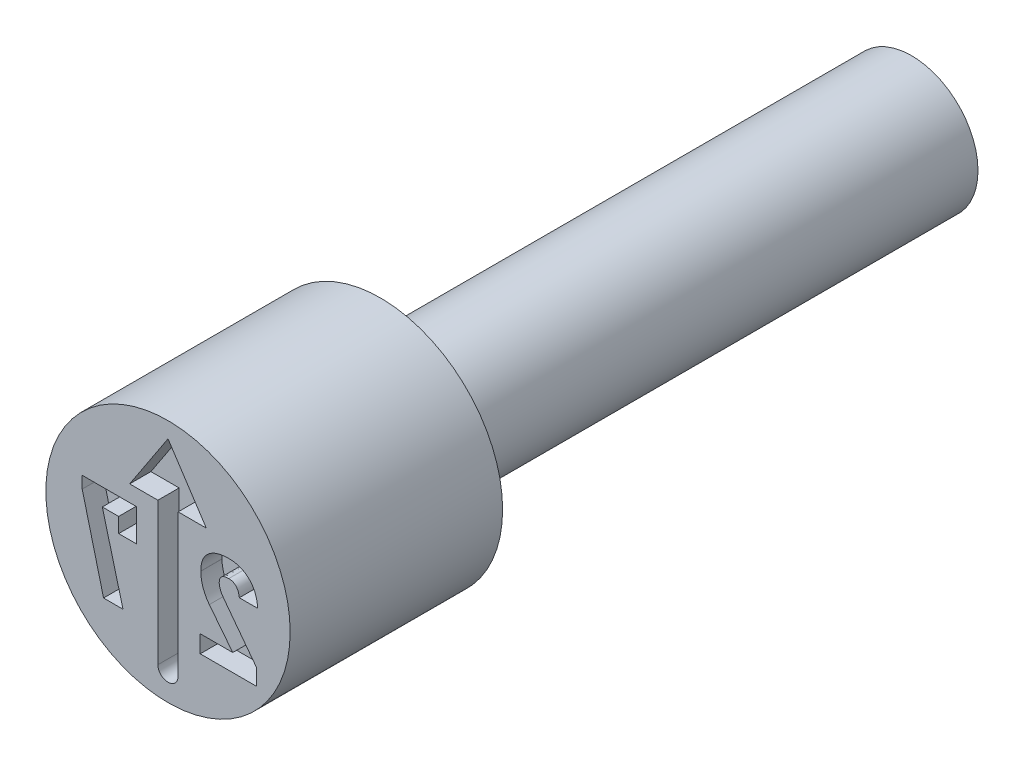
ISO-10303-21;
HEADER;
FILE_DESCRIPTION(('STEP AP214'),'2;1');
FILE_NAME('part.step','',(''),(''),'','','');
FILE_SCHEMA(('AUTOMOTIVE_DESIGN { 1 0 10303 214 1 1 1 1 }'));
ENDSEC;
DATA;
#1=APPLICATION_CONTEXT('core data for automotive mechanical design processes');
#2=APPLICATION_PROTOCOL_DEFINITION('international standard','automotive_design',2000,#1);
#3=PRODUCT_CONTEXT('',#1,'mechanical');
#4=PRODUCT('Part','Part','',(#3));
#5=PRODUCT_RELATED_PRODUCT_CATEGORY('part','',(#4));
#6=PRODUCT_DEFINITION_FORMATION('','',#4);
#7=PRODUCT_DEFINITION_CONTEXT('part definition',#1,'design');
#8=PRODUCT_DEFINITION('design','',#6,#7);
#9=PRODUCT_DEFINITION_SHAPE('','',#8);
#10=(LENGTH_UNIT() NAMED_UNIT(*) SI_UNIT(.MILLI.,.METRE.));
#11=(NAMED_UNIT(*) PLANE_ANGLE_UNIT() SI_UNIT($,.RADIAN.));
#12=(NAMED_UNIT(*) SI_UNIT($,.STERADIAN.) SOLID_ANGLE_UNIT());
#13=UNCERTAINTY_MEASURE_WITH_UNIT(LENGTH_MEASURE(1.E-05),#10,'distance_accuracy_value','');
#14=(GEOMETRIC_REPRESENTATION_CONTEXT(3) GLOBAL_UNCERTAINTY_ASSIGNED_CONTEXT((#13)) GLOBAL_UNIT_ASSIGNED_CONTEXT((#10,
#11,#12)) REPRESENTATION_CONTEXT('',''));
#15=CARTESIAN_POINT('',(0.,0.,0.));
#16=DIRECTION('',(0.,0.,1.));
#17=DIRECTION('',(1.,0.,0.));
#18=AXIS2_PLACEMENT_3D('',#15,#16,#17);
#19=CARTESIAN_POINT('',(0.,1.25,-4.));
#20=DIRECTION('',(0.,0.,1.));
#21=DIRECTION('',(1.,0.,0.));
#22=AXIS2_PLACEMENT_3D('',#19,#20,#21);
#23=PLANE('',#22);
#24=CARTESIAN_POINT('',(0.,0.,-4.));
#25=DIRECTION('',(0.,0.,1.));
#26=DIRECTION('',(1.,0.,0.));
#27=AXIS2_PLACEMENT_3D('',#24,#25,#26);
#28=CIRCLE('',#27,2.3);
#29=CARTESIAN_POINT('',(2.3,0.,-4.));
#30=VERTEX_POINT('',#29);
#31=EDGE_CURVE('E11',#30,#30,#28,.T.);
#32=ORIENTED_EDGE('',*,*,#31,.F.);
#33=EDGE_LOOP('',(#32));
#34=FACE_BOUND('',#33,.T.);
#35=CARTESIAN_POINT('',(0.,0.,-4.));
#36=DIRECTION('',(0.,0.,1.));
#37=DIRECTION('',(1.,0.,0.));
#38=AXIS2_PLACEMENT_3D('',#35,#36,#37);
#39=CIRCLE('',#38,1.25);
#40=CARTESIAN_POINT('',(1.25,0.,-4.));
#41=VERTEX_POINT('',#40);
#42=EDGE_CURVE('E405',#41,#41,#39,.T.);
#43=ORIENTED_EDGE('',*,*,#42,.T.);
#44=EDGE_LOOP('',(#43));
#45=FACE_BOUND('',#44,.T.);
#46=ADVANCED_FACE('F39',(#34,#45),#23,.F.);
#47=CARTESIAN_POINT('',(0.,0.,-0.403888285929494));
#48=DIRECTION('',(0.,0.,1.));
#49=DIRECTION('',(1.,0.,0.));
#50=AXIS2_PLACEMENT_3D('',#47,#48,#49);
#51=CYLINDRICAL_SURFACE('',#50,2.3);
#52=CARTESIAN_POINT('',(0.,0.,0.));
#53=DIRECTION('',(0.,0.,1.));
#54=DIRECTION('',(1.,0.,0.));
#55=AXIS2_PLACEMENT_3D('',#52,#53,#54);
#56=CIRCLE('',#55,2.3);
#57=CARTESIAN_POINT('',(2.3,0.,0.));
#58=VERTEX_POINT('',#57);
#59=EDGE_CURVE('E46',#58,#58,#56,.T.);
#60=ORIENTED_EDGE('',*,*,#59,.F.);
#61=EDGE_LOOP('',(#60));
#62=FACE_BOUND('',#61,.T.);
#63=ORIENTED_EDGE('',*,*,#31,.T.);
#64=EDGE_LOOP('',(#63));
#65=FACE_BOUND('',#64,.T.);
#66=ADVANCED_FACE('F390',(#62,#65),#51,.T.);
#67=CARTESIAN_POINT('',(0.,2.3,0.));
#68=DIRECTION('',(0.,0.,-1.));
#69=DIRECTION('',(-1.,0.,0.));
#70=AXIS2_PLACEMENT_3D('',#67,#68,#69);
#71=PLANE('',#70);
#72=DIRECTION('',(0.,1.,0.));
#73=VECTOR('',#72,1.);
#74=CARTESIAN_POINT('',(1.66668019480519,-1.2,0.));
#75=LINE('',#74,#73);
#76=CARTESIAN_POINT('',(1.66668019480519,-1.2,0.));
#77=VERTEX_POINT('',#76);
#78=CARTESIAN_POINT('',(1.66668019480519,-0.893912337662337,0.));
#79=VERTEX_POINT('',#78);
#80=EDGE_CURVE('E640',#77,#79,#75,.T.);
#81=ORIENTED_EDGE('',*,*,#80,.F.);
#82=DIRECTION('',(1.,0.,0.));
#83=VECTOR('',#82,1.);
#84=CARTESIAN_POINT('',(0.606696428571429,-1.2,0.));
#85=LINE('',#84,#83);
#86=CARTESIAN_POINT('',(0.606696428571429,-1.2,0.));
#87=VERTEX_POINT('',#86);
#88=EDGE_CURVE('E53',#87,#77,#85,.T.);
#89=ORIENTED_EDGE('',*,*,#88,.F.);
#90=DIRECTION('',(0.,-1.,0.));
#91=VECTOR('',#90,1.);
#92=CARTESIAN_POINT('',(0.606696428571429,-0.872727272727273,0.));
#93=LINE('',#92,#91);
#94=CARTESIAN_POINT('',(0.606696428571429,-0.872727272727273,0.));
#95=VERTEX_POINT('',#94);
#96=EDGE_CURVE('E274',#95,#87,#93,.T.);
#97=ORIENTED_EDGE('',*,*,#96,.F.);
#98=DIRECTION('',(-1.,0.,0.));
#99=VECTOR('',#98,1.);
#100=CARTESIAN_POINT('',(1.21923701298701,-0.872727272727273,0.));
#101=LINE('',#100,#99);
#102=CARTESIAN_POINT('',(1.21923701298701,-0.872727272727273,0.));
#103=VERTEX_POINT('',#102);
#104=EDGE_CURVE('E277',#103,#95,#101,.T.);
#105=ORIENTED_EDGE('',*,*,#104,.F.);
#106=DIRECTION('',(0.618183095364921,-0.78603413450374,0.));
#107=VECTOR('',#106,1.);
#108=CARTESIAN_POINT('',(0.778003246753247,-0.311688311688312,0.));
#109=LINE('',#108,#107);
#110=CARTESIAN_POINT('',(0.778003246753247,-0.311688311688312,0.));
#111=VERTEX_POINT('',#110);
#112=EDGE_CURVE('E571',#111,#103,#109,.T.);
#113=ORIENTED_EDGE('',*,*,#112,.F.);
#114=CARTESIAN_POINT('',(0.616558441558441,0.151461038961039,0.));
#115=CARTESIAN_POINT('',(0.617024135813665,0.130980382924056,0.));
#116=CARTESIAN_POINT('',(0.617956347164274,0.0899828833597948,0.));
#117=CARTESIAN_POINT('',(0.626371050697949,0.0286244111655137,0.));
#118=CARTESIAN_POINT('',(0.639931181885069,-0.0324207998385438,0.));
#119=CARTESIAN_POINT('',(0.658554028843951,-0.0928578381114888,0.));
#120=CARTESIAN_POINT('',(0.681688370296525,-0.151639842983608,0.));
#121=CARTESIAN_POINT('',(0.709454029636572,-0.207961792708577,0.));
#122=CARTESIAN_POINT('',(0.740791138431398,-0.261848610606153,0.));
#123=CARTESIAN_POINT('',(0.765622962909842,-0.29510689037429,0.));
#124=CARTESIAN_POINT('',(0.778003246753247,-0.311688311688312,0.));
#125=B_SPLINE_CURVE_WITH_KNOTS('',3,(#114,#115,#116,#117,#118,#119,#120,#121,#122,#123,#124),
.UNSPECIFIED.,.F.,.F.,(4,1,1,1,1,1,1,1,4),(0.,0.123046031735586,0.246309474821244,
0.371480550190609,0.498560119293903,0.626024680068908,0.750715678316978,0.875715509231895,1.),.UNSPECIFIED.);
#126=CARTESIAN_POINT('',(0.616558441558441,0.151461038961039,0.));
#127=VERTEX_POINT('',#126);
#128=EDGE_CURVE('E574',#127,#111,#125,.T.);
#129=ORIENTED_EDGE('',*,*,#128,.F.);
#130=DIRECTION('',(0.,-1.,0.));
#131=VECTOR('',#130,1.);
#132=CARTESIAN_POINT('',(0.616558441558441,0.152922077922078,0.));
#133=LINE('',#132,#131);
#134=CARTESIAN_POINT('',(0.616558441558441,0.152922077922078,0.));
#135=VERTEX_POINT('',#134);
#136=EDGE_CURVE('E579',#135,#127,#133,.T.);
#137=ORIENTED_EDGE('',*,*,#136,.F.);
#138=CARTESIAN_POINT('',(1.14655032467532,0.623376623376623,0.));
#139=CARTESIAN_POINT('',(1.12607927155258,0.623085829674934,0.));
#140=CARTESIAN_POINT('',(1.08626578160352,0.622520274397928,0.));
#141=CARTESIAN_POINT('',(1.02830422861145,0.61641528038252,0.));
#142=CARTESIAN_POINT('',(0.973768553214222,0.607201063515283,0.));
#143=CARTESIAN_POINT('',(0.922746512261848,0.593721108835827,0.));
#144=CARTESIAN_POINT('',(0.875442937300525,0.576137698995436,0.));
#145=CARTESIAN_POINT('',(0.831716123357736,0.554936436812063,0.));
#146=CARTESIAN_POINT('',(0.791474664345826,0.529936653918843,0.));
#147=CARTESIAN_POINT('',(0.755026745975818,0.501084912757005,0.));
#148=CARTESIAN_POINT('',(0.722232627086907,0.468905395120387,0.));
#149=CARTESIAN_POINT('',(0.694005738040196,0.433071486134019,0.));
#150=CARTESIAN_POINT('',(0.669570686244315,0.394307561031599,0.));
#151=CARTESIAN_POINT('',(0.650469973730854,0.3518617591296,0.));
#152=CARTESIAN_POINT('',(0.634744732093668,0.306732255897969,0.));
#153=CARTESIAN_POINT('',(0.624562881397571,0.25811011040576,0.));
#154=CARTESIAN_POINT('',(0.617701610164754,0.206567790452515,0.));
#155=CARTESIAN_POINT('',(0.616945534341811,0.171087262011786,0.));
#156=CARTESIAN_POINT('',(0.616558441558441,0.152922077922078,0.));
#157=B_SPLINE_CURVE_WITH_KNOTS('',3,(#138,#139,#140,#141,#142,#143,#144,#145,#146,#147,#148,
#149,#150,#151,#152,#153,#154,#155,#156),.UNSPECIFIED.,.F.,.F.,(4,1,1,1,1,1,1,1,1,1,1,1,1,1,1,1,
4),(0.,0.0762312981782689,0.148259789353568,0.216860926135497,0.28210063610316,
0.344528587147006,0.404571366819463,0.462840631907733,0.520642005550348,0.577409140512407,
0.633580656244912,0.690215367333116,0.747647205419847,0.806597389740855,0.867894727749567,
0.932365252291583,1.),.UNSPECIFIED.);
#158=CARTESIAN_POINT('',(1.14655032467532,0.623376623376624,0.));
#159=VERTEX_POINT('',#158);
#160=EDGE_CURVE('E585',#159,#135,#157,.T.);
#161=ORIENTED_EDGE('',*,*,#160,.F.);
#162=CARTESIAN_POINT('',(1.68896103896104,0.0831574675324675,0.));
#163=CARTESIAN_POINT('',(1.68725243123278,0.10402199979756,0.));
#164=CARTESIAN_POINT('',(1.68391726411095,0.144749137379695,0.));
#165=CARTESIAN_POINT('',(1.67298313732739,0.203662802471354,0.));
#166=CARTESIAN_POINT('',(1.658851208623,0.259155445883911,0.));
#167=CARTESIAN_POINT('',(1.64087349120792,0.311216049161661,0.));
#168=CARTESIAN_POINT('',(1.61777206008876,0.359241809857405,0.));
#169=CARTESIAN_POINT('',(1.59181690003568,0.404236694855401,0.));
#170=CARTESIAN_POINT('',(1.56059934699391,0.444809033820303,0.));
#171=CARTESIAN_POINT('',(1.52642736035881,0.482316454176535,0.));
#172=CARTESIAN_POINT('',(1.48836587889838,0.515352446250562,0.));
#173=CARTESIAN_POINT('',(1.44778188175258,0.544494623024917,0.));
#174=CARTESIAN_POINT('',(1.40406167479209,0.568745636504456,0.));
#175=CARTESIAN_POINT('',(1.35786992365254,0.588863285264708,0.));
#176=CARTESIAN_POINT('',(1.3086944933,0.604132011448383,0.));
#177=CARTESIAN_POINT('',(1.2571777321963,0.615569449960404,0.));
#178=CARTESIAN_POINT('',(1.20272832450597,0.622165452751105,0.));
#179=CARTESIAN_POINT('',(1.16556147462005,0.622966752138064,0.));
#180=CARTESIAN_POINT('',(1.14655032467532,0.623376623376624,0.));
#181=B_SPLINE_CURVE_WITH_KNOTS('',3,(#162,#163,#164,#165,#166,#167,#168,#169,#170,#171,#172,
#173,#174,#175,#176,#177,#178,#179,#180),.UNSPECIFIED.,.F.,.F.,(4,1,1,1,1,1,1,1,1,1,1,1,1,1,1,1,
4),(0.,0.0733268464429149,0.14313249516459,0.209679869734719,0.273918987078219,0.33576228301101,
0.396210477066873,0.45560885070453,0.514796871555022,0.573764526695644,0.631900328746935,
0.689592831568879,0.748648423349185,0.808163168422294,0.86976604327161,0.933384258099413,1.),.UNSPECIFIED.);
#182=CARTESIAN_POINT('',(1.68896103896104,0.0831574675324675,0.));
#183=VERTEX_POINT('',#182);
#184=EDGE_CURVE('E590',#183,#159,#181,.T.);
#185=ORIENTED_EDGE('',*,*,#184,.F.);
#186=DIRECTION('',(0.,1.,0.));
#187=VECTOR('',#186,1.);
#188=CARTESIAN_POINT('',(1.68896103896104,0.0820616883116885,0.));
#189=LINE('',#188,#187);
#190=CARTESIAN_POINT('',(1.68896103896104,0.0820616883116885,0.));
#191=VERTEX_POINT('',#190);
#192=EDGE_CURVE('E598',#191,#183,#189,.T.);
#193=ORIENTED_EDGE('',*,*,#192,.F.);
#194=DIRECTION('',(1.,0.,0.));
#195=VECTOR('',#194,1.);
#196=CARTESIAN_POINT('',(1.34269480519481,0.0820616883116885,0.));
#197=LINE('',#196,#195);
#198=CARTESIAN_POINT('',(1.34269480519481,0.0820616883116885,0.));
#199=VERTEX_POINT('',#198);
#200=EDGE_CURVE('E604',#199,#191,#197,.T.);
#201=ORIENTED_EDGE('',*,*,#200,.F.);
#202=DIRECTION('',(0.,-1.,0.));
#203=VECTOR('',#202,1.);
#204=CARTESIAN_POINT('',(1.34269480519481,0.0831574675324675,0.));
#205=LINE('',#204,#203);
#206=CARTESIAN_POINT('',(1.34269480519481,0.0831574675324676,0.));
#207=VERTEX_POINT('',#206);
#208=EDGE_CURVE('E607',#207,#199,#205,.T.);
#209=ORIENTED_EDGE('',*,*,#208,.F.);
#210=CARTESIAN_POINT('',(1.14399350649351,0.296103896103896,0.));
#211=CARTESIAN_POINT('',(1.15722614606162,0.295587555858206,0.));
#212=CARTESIAN_POINT('',(1.18293762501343,0.294584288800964,0.));
#213=CARTESIAN_POINT('',(1.21933660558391,0.283465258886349,0.));
#214=CARTESIAN_POINT('',(1.25213563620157,0.266024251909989,0.));
#215=CARTESIAN_POINT('',(1.28041100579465,0.241138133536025,0.));
#216=CARTESIAN_POINT('',(1.3038251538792,0.209892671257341,0.));
#217=CARTESIAN_POINT('',(1.32282800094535,0.173098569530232,0.));
#218=CARTESIAN_POINT('',(1.33573459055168,0.130091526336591,0.));
#219=CARTESIAN_POINT('',(1.34030007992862,0.0993055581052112,0.));
#220=CARTESIAN_POINT('',(1.34269480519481,0.0831574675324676,0.));
#221=B_SPLINE_CURVE_WITH_KNOTS('',3,(#210,#211,#212,#213,#214,#215,#216,#217,#218,#219,#220),
.UNSPECIFIED.,.F.,.F.,(4,1,1,1,1,1,1,1,4),(0.,0.122603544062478,0.238222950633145,
0.350089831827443,0.465559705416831,0.58502806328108,0.711014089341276,0.848418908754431,1.),.UNSPECIFIED.);
#222=CARTESIAN_POINT('',(1.14399350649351,0.296103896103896,0.));
#223=VERTEX_POINT('',#222);
#224=EDGE_CURVE('E610',#223,#207,#221,.T.);
#225=ORIENTED_EDGE('',*,*,#224,.F.);
#226=CARTESIAN_POINT('',(0.964285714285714,0.143425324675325,0.));
#227=CARTESIAN_POINT('',(0.964784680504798,0.154934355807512,0.));
#228=CARTESIAN_POINT('',(0.965740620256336,0.17698382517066,0.));
#229=CARTESIAN_POINT('',(0.97474707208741,0.208051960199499,0.));
#230=CARTESIAN_POINT('',(0.989508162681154,0.235107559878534,0.));
#231=CARTESIAN_POINT('',(1.0106496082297,0.257455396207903,0.));
#232=CARTESIAN_POINT('',(1.03696908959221,0.275131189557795,0.));
#233=CARTESIAN_POINT('',(1.06846107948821,0.287588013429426,0.));
#234=CARTESIAN_POINT('',(1.10471353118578,0.294731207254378,0.));
#235=CARTESIAN_POINT('',(1.13044539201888,0.295630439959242,0.));
#236=CARTESIAN_POINT('',(1.14399350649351,0.296103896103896,0.));
#237=B_SPLINE_CURVE_WITH_KNOTS('',3,(#226,#227,#228,#229,#230,#231,#232,#233,#234,#235,#236),
.UNSPECIFIED.,.F.,.F.,(4,1,1,1,1,1,1,1,4),(0.,0.128749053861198,0.246662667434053,
0.359069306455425,0.47107757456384,0.588039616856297,0.711712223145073,0.848213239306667,1.),.UNSPECIFIED.);
#238=CARTESIAN_POINT('',(0.964285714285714,0.143425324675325,0.));
#239=VERTEX_POINT('',#238);
#240=EDGE_CURVE('E615',#239,#223,#237,.T.);
#241=ORIENTED_EDGE('',*,*,#240,.F.);
#242=DIRECTION('',(0.,1.,0.));
#243=VECTOR('',#242,1.);
#244=CARTESIAN_POINT('',(0.964285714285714,0.140868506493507,0.));
#245=LINE('',#244,#243);
#246=CARTESIAN_POINT('',(0.964285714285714,0.140868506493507,0.));
#247=VERTEX_POINT('',#246);
#248=EDGE_CURVE('E623',#247,#239,#245,.T.);
#249=ORIENTED_EDGE('',*,*,#248,.F.);
#250=CARTESIAN_POINT('',(1.05158279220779,-0.0790178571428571,0.));
#251=CARTESIAN_POINT('',(1.03869946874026,-0.0608645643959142,0.));
#252=CARTESIAN_POINT('',(1.01359670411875,-0.0254934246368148,0.));
#253=CARTESIAN_POINT('',(0.990876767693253,0.0230816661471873,0.));
#254=CARTESIAN_POINT('',(0.976723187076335,0.0611651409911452,0.));
#255=CARTESIAN_POINT('',(0.969977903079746,0.0887831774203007,0.));
#256=CARTESIAN_POINT('',(0.965166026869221,0.115133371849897,0.));
#257=CARTESIAN_POINT('',(0.964573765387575,0.132447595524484,0.));
#258=CARTESIAN_POINT('',(0.964285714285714,0.140868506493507,0.));
#259=B_SPLINE_CURVE_WITH_KNOTS('',3,(#250,#251,#252,#253,#254,#255,#256,#257,#258),
.UNSPECIFIED.,.F.,.F.,(4,1,1,1,1,1,4),(0.,0.27737542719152,0.540457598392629,0.666416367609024,
0.784009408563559,0.894951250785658,1.),.UNSPECIFIED.);
#260=CARTESIAN_POINT('',(1.05158279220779,-0.0790178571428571,0.));
#261=VERTEX_POINT('',#260);
#262=EDGE_CURVE('E629',#261,#247,#259,.T.);
#263=ORIENTED_EDGE('',*,*,#262,.F.);
#264=DIRECTION('',(-0.602458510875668,0.798150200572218,0.));
#265=VECTOR('',#264,1.);
#266=CARTESIAN_POINT('',(1.66668019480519,-0.893912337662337,0.));
#267=LINE('',#266,#265);
#268=EDGE_CURVE('E634',#79,#261,#267,.T.);
#269=ORIENTED_EDGE('',*,*,#268,.F.);
#270=EDGE_LOOP('',(#81,#89,#97,#105,#113,#129,#137,#161,#185,#193,#201,#209,#225,#241,#249,#263,#269));
#271=FACE_BOUND('',#270,.T.);
#272=DIRECTION('',(0.,-1.,0.));
#273=VECTOR('',#272,1.);
#274=CARTESIAN_POINT('',(-1.61514935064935,0.6,0.));
#275=LINE('',#274,#273);
#276=CARTESIAN_POINT('',(-1.61514935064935,0.6,0.));
#277=VERTEX_POINT('',#276);
#278=CARTESIAN_POINT('',(-1.61514935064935,0.374269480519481,0.));
#279=VERTEX_POINT('',#278);
#280=EDGE_CURVE('E510',#277,#279,#275,.T.);
#281=ORIENTED_EDGE('',*,*,#280,.F.);
#282=DIRECTION('',(-1.,0.,0.));
#283=VECTOR('',#282,1.);
#284=CARTESIAN_POINT('',(-0.590961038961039,0.6,0.));
#285=LINE('',#284,#283);
#286=CARTESIAN_POINT('',(-0.590961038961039,0.6,0.));
#287=VERTEX_POINT('',#286);
#288=EDGE_CURVE('E61',#287,#277,#285,.T.);
#289=ORIENTED_EDGE('',*,*,#288,.F.);
#290=DIRECTION('',(0.,1.,0.));
#291=VECTOR('',#290,1.);
#292=CARTESIAN_POINT('',(-0.590961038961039,-0.00779220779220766,0.));
#293=LINE('',#292,#291);
#294=CARTESIAN_POINT('',(-0.590961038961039,-0.00779220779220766,0.));
#295=VERTEX_POINT('',#294);
#296=EDGE_CURVE('E488',#295,#287,#293,.T.);
#297=ORIENTED_EDGE('',*,*,#296,.F.);
#298=DIRECTION('',(1.,0.,0.));
#299=VECTOR('',#298,1.);
#300=CARTESIAN_POINT('',(-0.9288262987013,-0.00779220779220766,0.));
#301=LINE('',#300,#299);
#302=CARTESIAN_POINT('',(-0.9288262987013,-0.00779220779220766,0.));
#303=VERTEX_POINT('',#302);
#304=EDGE_CURVE('E492',#303,#295,#301,.T.);
#305=ORIENTED_EDGE('',*,*,#304,.F.);
#306=DIRECTION('',(0.,-1.,0.));
#307=VECTOR('',#306,1.);
#308=CARTESIAN_POINT('',(-0.9288262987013,0.272727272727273,0.));
#309=LINE('',#308,#307);
#310=CARTESIAN_POINT('',(-0.9288262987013,0.272727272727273,0.));
#311=VERTEX_POINT('',#310);
#312=EDGE_CURVE('E495',#311,#303,#309,.T.);
#313=ORIENTED_EDGE('',*,*,#312,.F.);
#314=DIRECTION('',(1.,0.,0.));
#315=VECTOR('',#314,1.);
#316=CARTESIAN_POINT('',(-1.23674025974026,0.272727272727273,0.));
#317=LINE('',#316,#315);
#318=CARTESIAN_POINT('',(-1.23674025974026,0.272727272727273,0.));
#319=VERTEX_POINT('',#318);
#320=EDGE_CURVE('E498',#319,#311,#317,.T.);
#321=ORIENTED_EDGE('',*,*,#320,.F.);
#322=DIRECTION('',(-0.255602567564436,0.966781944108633,0.));
#323=VECTOR('',#322,1.);
#324=CARTESIAN_POINT('',(-0.847373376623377,-1.2,0.));
#325=LINE('',#324,#323);
#326=CARTESIAN_POINT('',(-0.847373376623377,-1.2,0.));
#327=VERTEX_POINT('',#326);
#328=EDGE_CURVE('E501',#327,#319,#325,.T.);
#329=ORIENTED_EDGE('',*,*,#328,.F.);
#330=DIRECTION('',(1.,0.,0.));
#331=VECTOR('',#330,1.);
#332=CARTESIAN_POINT('',(-1.21336363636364,-1.2,0.));
#333=LINE('',#332,#331);
#334=CARTESIAN_POINT('',(-1.21336363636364,-1.2,0.));
#335=VERTEX_POINT('',#334);
#336=EDGE_CURVE('E504',#335,#327,#333,.T.);
#337=ORIENTED_EDGE('',*,*,#336,.F.);
#338=DIRECTION('',(0.247293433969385,-0.968940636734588,0.));
#339=VECTOR('',#338,1.);
#340=CARTESIAN_POINT('',(-1.61514935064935,0.374269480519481,0.));
#341=LINE('',#340,#339);
#342=EDGE_CURVE('E507',#279,#335,#341,.T.);
#343=ORIENTED_EDGE('',*,*,#342,.F.);
#344=EDGE_LOOP('',(#281,#289,#297,#305,#313,#321,#329,#337,#343));
#345=FACE_BOUND('',#344,.T.);
#346=DIRECTION('',(0.,1.,0.));
#347=VECTOR('',#346,1.);
#348=CARTESIAN_POINT('',(0.190473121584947,0.906351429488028,0.));
#349=LINE('',#348,#347);
#350=CARTESIAN_POINT('',(0.190473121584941,-1.77616183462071,0.));
#351=VERTEX_POINT('',#350);
#352=CARTESIAN_POINT('',(0.190473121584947,0.906351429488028,0.));
#353=VERTEX_POINT('',#352);
#354=EDGE_CURVE('E444',#351,#353,#349,.T.);
#355=ORIENTED_EDGE('',*,*,#354,.F.);
#356=CARTESIAN_POINT('',(1.6342449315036E-13,-1.77616183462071,0.));
#357=DIRECTION('',(0.,0.,1.));
#358=DIRECTION('',(1.,0.,0.));
#359=AXIS2_PLACEMENT_3D('',#356,#357,#358);
#360=CIRCLE('',#359,0.190473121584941);
#361=CARTESIAN_POINT('',(-0.190473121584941,-1.77616183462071,0.));
#362=VERTEX_POINT('',#361);
#363=EDGE_CURVE('E447',#362,#351,#360,.T.);
#364=ORIENTED_EDGE('',*,*,#363,.F.);
#365=DIRECTION('',(0.,-1.,0.));
#366=VECTOR('',#365,1.);
#367=CARTESIAN_POINT('',(-0.190473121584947,0.906351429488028,0.));
#368=LINE('',#367,#366);
#369=CARTESIAN_POINT('',(-0.190473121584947,0.906351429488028,0.));
#370=VERTEX_POINT('',#369);
#371=EDGE_CURVE('E428',#370,#362,#368,.T.);
#372=ORIENTED_EDGE('',*,*,#371,.F.);
#373=DIRECTION('',(1.,0.,0.));
#374=VECTOR('',#373,1.);
#375=CARTESIAN_POINT('',(-0.721917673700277,0.906351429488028,0.));
#376=LINE('',#375,#374);
#377=CARTESIAN_POINT('',(-0.721917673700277,0.906351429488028,0.));
#378=VERTEX_POINT('',#377);
#379=EDGE_CURVE('E432',#378,#370,#376,.T.);
#380=ORIENTED_EDGE('',*,*,#379,.F.);
#381=DIRECTION('',(-0.550159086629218,-0.835059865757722,0.));
#382=VECTOR('',#381,1.);
#383=CARTESIAN_POINT('',(0.,2.00211534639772,0.));
#384=LINE('',#383,#382);
#385=CARTESIAN_POINT('',(0.,2.00211534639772,0.));
#386=VERTEX_POINT('',#385);
#387=EDGE_CURVE('E435',#386,#378,#384,.T.);
#388=ORIENTED_EDGE('',*,*,#387,.F.);
#389=DIRECTION('',(-0.550159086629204,0.835059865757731,0.));
#390=VECTOR('',#389,1.);
#391=CARTESIAN_POINT('',(0.,2.00211534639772,0.));
#392=LINE('',#391,#390);
#393=CARTESIAN_POINT('',(0.721917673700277,0.906351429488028,0.));
#394=VERTEX_POINT('',#393);
#395=EDGE_CURVE('E438',#394,#386,#392,.T.);
#396=ORIENTED_EDGE('',*,*,#395,.F.);
#397=DIRECTION('',(1.,0.,0.));
#398=VECTOR('',#397,1.);
#399=CARTESIAN_POINT('',(0.721917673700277,0.906351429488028,0.));
#400=LINE('',#399,#398);
#401=EDGE_CURVE('E441',#353,#394,#400,.T.);
#402=ORIENTED_EDGE('',*,*,#401,.F.);
#403=EDGE_LOOP('',(#355,#364,#372,#380,#388,#396,#402));
#404=FACE_BOUND('',#403,.T.);
#405=ORIENTED_EDGE('',*,*,#59,.T.);
#406=EDGE_LOOP('',(#405));
#407=FACE_BOUND('',#406,.T.);
#408=ADVANCED_FACE('F387',(#271,#345,#404,#407),#71,.F.);
#409=CARTESIAN_POINT('',(0.,0.,-14.));
#410=DIRECTION('',(0.,0.,1.));
#411=DIRECTION('',(1.,0.,0.));
#412=AXIS2_PLACEMENT_3D('',#409,#410,#411);
#413=PLANE('',#412);
#414=CARTESIAN_POINT('',(0.,0.,-14.));
#415=DIRECTION('',(0.,0.,1.));
#416=DIRECTION('',(1.,0.,0.));
#417=AXIS2_PLACEMENT_3D('',#414,#415,#416);
#418=CIRCLE('',#417,1.25);
#419=CARTESIAN_POINT('',(1.25,0.,-14.));
#420=VERTEX_POINT('',#419);
#421=EDGE_CURVE('E406',#420,#420,#418,.T.);
#422=ORIENTED_EDGE('',*,*,#421,.F.);
#423=EDGE_LOOP('',(#422));
#424=FACE_BOUND('',#423,.T.);
#425=ADVANCED_FACE('F383',(#424),#413,.F.);
#426=CARTESIAN_POINT('',(0.,0.,-0.403888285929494));
#427=DIRECTION('',(0.,0.,1.));
#428=DIRECTION('',(1.,0.,0.));
#429=AXIS2_PLACEMENT_3D('',#426,#427,#428);
#430=CYLINDRICAL_SURFACE('',#429,1.25);
#431=ORIENTED_EDGE('',*,*,#42,.F.);
#432=EDGE_LOOP('',(#431));
#433=FACE_BOUND('',#432,.T.);
#434=ORIENTED_EDGE('',*,*,#421,.T.);
#435=EDGE_LOOP('',(#434));
#436=FACE_BOUND('',#435,.T.);
#437=ADVANCED_FACE('F379',(#433,#436),#430,.T.);
#438=CARTESIAN_POINT('',(1.6342449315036E-13,-1.77616183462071,-0.4));
#439=DIRECTION('',(0.,0.,1.));
#440=DIRECTION('',(1.,0.,0.));
#441=AXIS2_PLACEMENT_3D('',#438,#439,#440);
#442=CYLINDRICAL_SURFACE('',#441,0.190473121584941);
#443=ORIENTED_EDGE('',*,*,#363,.T.);
#444=DIRECTION('',(0.,0.,1.));
#445=VECTOR('',#444,1.);
#446=CARTESIAN_POINT('',(0.190473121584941,-1.77616183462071,-0.4));
#447=LINE('',#446,#445);
#448=CARTESIAN_POINT('',(0.190473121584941,-1.77616183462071,-0.4));
#449=VERTEX_POINT('',#448);
#450=EDGE_CURVE('E414',#449,#351,#447,.T.);
#451=ORIENTED_EDGE('',*,*,#450,.F.);
#452=CARTESIAN_POINT('',(1.6342449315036E-13,-1.77616183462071,-0.4));
#453=DIRECTION('',(0.,0.,1.));
#454=DIRECTION('',(1.,0.,0.));
#455=AXIS2_PLACEMENT_3D('',#452,#453,#454);
#456=CIRCLE('',#455,0.190473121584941);
#457=CARTESIAN_POINT('',(-0.190473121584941,-1.77616183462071,-0.4));
#458=VERTEX_POINT('',#457);
#459=EDGE_CURVE('E431',#458,#449,#456,.T.);
#460=ORIENTED_EDGE('',*,*,#459,.F.);
#461=DIRECTION('',(0.,0.,1.));
#462=VECTOR('',#461,1.);
#463=CARTESIAN_POINT('',(-0.190473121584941,-1.77616183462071,-0.4));
#464=LINE('',#463,#462);
#465=EDGE_CURVE('E407',#458,#362,#464,.T.);
#466=ORIENTED_EDGE('',*,*,#465,.T.);
#467=EDGE_LOOP('',(#443,#451,#460,#466));
#468=FACE_BOUND('',#467,.T.);
#469=ADVANCED_FACE('F357',(#468),#442,.F.);
#470=CARTESIAN_POINT('',(-0.190473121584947,0.906351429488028,-0.4));
#471=DIRECTION('',(-1.,0.,0.));
#472=DIRECTION('',(0.,-1.,0.));
#473=AXIS2_PLACEMENT_3D('',#470,#471,#472);
#474=PLANE('',#473);
#475=ORIENTED_EDGE('',*,*,#371,.T.);
#476=ORIENTED_EDGE('',*,*,#465,.F.);
#477=DIRECTION('',(0.,-1.,0.));
#478=VECTOR('',#477,1.);
#479=CARTESIAN_POINT('',(-0.190473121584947,0.906351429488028,-0.4));
#480=LINE('',#479,#478);
#481=CARTESIAN_POINT('',(-0.190473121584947,0.906351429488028,-0.4));
#482=VERTEX_POINT('',#481);
#483=EDGE_CURVE('E419',#482,#458,#480,.T.);
#484=ORIENTED_EDGE('',*,*,#483,.F.);
#485=DIRECTION('',(0.,0.,1.));
#486=VECTOR('',#485,1.);
#487=CARTESIAN_POINT('',(-0.190473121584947,0.906351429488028,-0.4));
#488=LINE('',#487,#486);
#489=EDGE_CURVE('E411',#482,#370,#488,.T.);
#490=ORIENTED_EDGE('',*,*,#489,.T.);
#491=EDGE_LOOP('',(#475,#476,#484,#490));
#492=FACE_BOUND('',#491,.T.);
#493=ADVANCED_FACE('F353',(#492),#474,.F.);
#494=CARTESIAN_POINT('',(-0.721917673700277,0.906351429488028,-0.4));
#495=DIRECTION('',(0.,-1.,0.));
#496=DIRECTION('',(0.,0.,-1.));
#497=AXIS2_PLACEMENT_3D('',#494,#495,#496);
#498=PLANE('',#497);
#499=ORIENTED_EDGE('',*,*,#379,.T.);
#500=ORIENTED_EDGE('',*,*,#489,.F.);
#501=DIRECTION('',(1.,0.,0.));
#502=VECTOR('',#501,1.);
#503=CARTESIAN_POINT('',(-0.721917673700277,0.906351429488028,-0.4));
#504=LINE('',#503,#502);
#505=CARTESIAN_POINT('',(-0.721917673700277,0.906351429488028,-0.4));
#506=VERTEX_POINT('',#505);
#507=EDGE_CURVE('E452',#506,#482,#504,.T.);
#508=ORIENTED_EDGE('',*,*,#507,.F.);
#509=DIRECTION('',(0.,0.,1.));
#510=VECTOR('',#509,1.);
#511=CARTESIAN_POINT('',(-0.721917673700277,0.906351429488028,-0.4));
#512=LINE('',#511,#510);
#513=EDGE_CURVE('E425',#506,#378,#512,.T.);
#514=ORIENTED_EDGE('',*,*,#513,.T.);
#515=EDGE_LOOP('',(#499,#500,#508,#514));
#516=FACE_BOUND('',#515,.T.);
#517=ADVANCED_FACE('F356',(#516),#498,.F.);
#518=CARTESIAN_POINT('',(0.,2.00211534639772,-0.4));
#519=DIRECTION('',(-0.835059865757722,0.550159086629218,0.));
#520=DIRECTION('',(-0.550159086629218,-0.835059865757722,0.));
#521=AXIS2_PLACEMENT_3D('',#518,#519,#520);
#522=PLANE('',#521);
#523=ORIENTED_EDGE('',*,*,#387,.T.);
#524=ORIENTED_EDGE('',*,*,#513,.F.);
#525=DIRECTION('',(-0.550159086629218,-0.835059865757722,0.));
#526=VECTOR('',#525,1.);
#527=CARTESIAN_POINT('',(0.,2.00211534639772,-0.4));
#528=LINE('',#527,#526);
#529=CARTESIAN_POINT('',(0.,2.00211534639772,-0.4));
#530=VERTEX_POINT('',#529);
#531=EDGE_CURVE('E455',#530,#506,#528,.T.);
#532=ORIENTED_EDGE('',*,*,#531,.F.);
#533=DIRECTION('',(0.,0.,1.));
#534=VECTOR('',#533,1.);
#535=CARTESIAN_POINT('',(0.,2.00211534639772,-0.4));
#536=LINE('',#535,#534);
#537=EDGE_CURVE('E423',#530,#386,#536,.T.);
#538=ORIENTED_EDGE('',*,*,#537,.T.);
#539=EDGE_LOOP('',(#523,#524,#532,#538));
#540=FACE_BOUND('',#539,.T.);
#541=ADVANCED_FACE('F361',(#540),#522,.F.);
#542=CARTESIAN_POINT('',(0.,2.00211534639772,-0.4));
#543=DIRECTION('',(0.835059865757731,0.550159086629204,0.));
#544=DIRECTION('',(-0.550159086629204,0.835059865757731,0.));
#545=AXIS2_PLACEMENT_3D('',#542,#543,#544);
#546=PLANE('',#545);
#547=ORIENTED_EDGE('',*,*,#395,.T.);
#548=ORIENTED_EDGE('',*,*,#537,.F.);
#549=DIRECTION('',(-0.550159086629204,0.835059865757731,0.));
#550=VECTOR('',#549,1.);
#551=CARTESIAN_POINT('',(0.,2.00211534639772,-0.4));
#552=LINE('',#551,#550);
#553=CARTESIAN_POINT('',(0.721917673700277,0.906351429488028,-0.4));
#554=VERTEX_POINT('',#553);
#555=EDGE_CURVE('E458',#554,#530,#552,.T.);
#556=ORIENTED_EDGE('',*,*,#555,.F.);
#557=DIRECTION('',(0.,0.,1.));
#558=VECTOR('',#557,1.);
#559=CARTESIAN_POINT('',(0.721917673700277,0.906351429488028,-0.4));
#560=LINE('',#559,#558);
#561=EDGE_CURVE('E421',#554,#394,#560,.T.);
#562=ORIENTED_EDGE('',*,*,#561,.T.);
#563=EDGE_LOOP('',(#547,#548,#556,#562));
#564=FACE_BOUND('',#563,.T.);
#565=ADVANCED_FACE('F365',(#564),#546,.F.);
#566=CARTESIAN_POINT('',(0.721917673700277,0.906351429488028,-0.4));
#567=DIRECTION('',(0.,-1.,0.));
#568=DIRECTION('',(0.,0.,-1.));
#569=AXIS2_PLACEMENT_3D('',#566,#567,#568);
#570=PLANE('',#569);
#571=ORIENTED_EDGE('',*,*,#401,.T.);
#572=ORIENTED_EDGE('',*,*,#561,.F.);
#573=DIRECTION('',(1.,0.,0.));
#574=VECTOR('',#573,1.);
#575=CARTESIAN_POINT('',(0.721917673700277,0.906351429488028,-0.4));
#576=LINE('',#575,#574);
#577=CARTESIAN_POINT('',(0.190473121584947,0.906351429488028,-0.4));
#578=VERTEX_POINT('',#577);
#579=EDGE_CURVE('E461',#578,#554,#576,.T.);
#580=ORIENTED_EDGE('',*,*,#579,.F.);
#581=DIRECTION('',(0.,0.,1.));
#582=VECTOR('',#581,1.);
#583=CARTESIAN_POINT('',(0.190473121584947,0.906351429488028,-0.4));
#584=LINE('',#583,#582);
#585=EDGE_CURVE('E418',#578,#353,#584,.T.);
#586=ORIENTED_EDGE('',*,*,#585,.T.);
#587=EDGE_LOOP('',(#571,#572,#580,#586));
#588=FACE_BOUND('',#587,.T.);
#589=ADVANCED_FACE('F369',(#588),#570,.F.);
#590=CARTESIAN_POINT('',(0.190473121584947,0.906351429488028,-0.4));
#591=DIRECTION('',(1.,0.,0.));
#592=DIRECTION('',(0.,1.,0.));
#593=AXIS2_PLACEMENT_3D('',#590,#591,#592);
#594=PLANE('',#593);
#595=ORIENTED_EDGE('',*,*,#354,.T.);
#596=ORIENTED_EDGE('',*,*,#585,.F.);
#597=DIRECTION('',(0.,1.,0.));
#598=VECTOR('',#597,1.);
#599=CARTESIAN_POINT('',(0.190473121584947,0.906351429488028,-0.4));
#600=LINE('',#599,#598);
#601=EDGE_CURVE('E464',#449,#578,#600,.T.);
#602=ORIENTED_EDGE('',*,*,#601,.F.);
#603=ORIENTED_EDGE('',*,*,#450,.T.);
#604=EDGE_LOOP('',(#595,#596,#602,#603));
#605=FACE_BOUND('',#604,.T.);
#606=ADVANCED_FACE('F351',(#605),#594,.F.);
#607=CARTESIAN_POINT('',(1.6342449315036E-13,-1.77616183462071,-0.4));
#608=DIRECTION('',(0.,0.,1.));
#609=DIRECTION('',(1.,0.,0.));
#610=AXIS2_PLACEMENT_3D('',#607,#608,#609);
#611=PLANE('',#610);
#612=ORIENTED_EDGE('',*,*,#459,.T.);
#613=ORIENTED_EDGE('',*,*,#601,.T.);
#614=ORIENTED_EDGE('',*,*,#579,.T.);
#615=ORIENTED_EDGE('',*,*,#555,.T.);
#616=ORIENTED_EDGE('',*,*,#531,.T.);
#617=ORIENTED_EDGE('',*,*,#507,.T.);
#618=ORIENTED_EDGE('',*,*,#483,.T.);
#619=EDGE_LOOP('',(#612,#613,#614,#615,#616,#617,#618));
#620=FACE_BOUND('',#619,.T.);
#621=ADVANCED_FACE('F348',(#620),#611,.T.);
#622=CARTESIAN_POINT('',(-0.590961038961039,0.6,-0.4));
#623=DIRECTION('',(0.,1.,0.));
#624=DIRECTION('',(0.,0.,1.));
#625=AXIS2_PLACEMENT_3D('',#622,#623,#624);
#626=PLANE('',#625);
#627=ORIENTED_EDGE('',*,*,#288,.T.);
#628=DIRECTION('',(0.,0.,1.));
#629=VECTOR('',#628,1.);
#630=CARTESIAN_POINT('',(-1.61514935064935,0.6,-0.4));
#631=LINE('',#630,#629);
#632=CARTESIAN_POINT('',(-1.61514935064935,0.6,-0.4));
#633=VERTEX_POINT('',#632);
#634=EDGE_CURVE('E469',#633,#277,#631,.T.);
#635=ORIENTED_EDGE('',*,*,#634,.F.);
#636=DIRECTION('',(-1.,0.,0.));
#637=VECTOR('',#636,1.);
#638=CARTESIAN_POINT('',(-0.590961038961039,0.6,-0.4));
#639=LINE('',#638,#637);
#640=CARTESIAN_POINT('',(-0.590961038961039,0.6,-0.4));
#641=VERTEX_POINT('',#640);
#642=EDGE_CURVE('E491',#641,#633,#639,.T.);
#643=ORIENTED_EDGE('',*,*,#642,.F.);
#644=DIRECTION('',(0.,0.,1.));
#645=VECTOR('',#644,1.);
#646=CARTESIAN_POINT('',(-0.590961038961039,0.6,-0.4));
#647=LINE('',#646,#645);
#648=EDGE_CURVE('E486',#641,#287,#647,.T.);
#649=ORIENTED_EDGE('',*,*,#648,.T.);
#650=EDGE_LOOP('',(#627,#635,#643,#649));
#651=FACE_BOUND('',#650,.T.);
#652=ADVANCED_FACE('F318',(#651),#626,.F.);
#653=CARTESIAN_POINT('',(-0.590961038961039,-0.00779220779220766,-0.4));
#654=DIRECTION('',(1.,0.,0.));
#655=DIRECTION('',(0.,0.,-1.));
#656=AXIS2_PLACEMENT_3D('',#653,#654,#655);
#657=PLANE('',#656);
#658=ORIENTED_EDGE('',*,*,#296,.T.);
#659=ORIENTED_EDGE('',*,*,#648,.F.);
#660=DIRECTION('',(0.,1.,0.));
#661=VECTOR('',#660,1.);
#662=CARTESIAN_POINT('',(-0.590961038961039,-0.00779220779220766,-0.4));
#663=LINE('',#662,#661);
#664=CARTESIAN_POINT('',(-0.590961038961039,-0.00779220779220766,-0.4));
#665=VERTEX_POINT('',#664);
#666=EDGE_CURVE('E472',#665,#641,#663,.T.);
#667=ORIENTED_EDGE('',*,*,#666,.F.);
#668=DIRECTION('',(0.,0.,1.));
#669=VECTOR('',#668,1.);
#670=CARTESIAN_POINT('',(-0.590961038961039,-0.00779220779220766,-0.4));
#671=LINE('',#670,#669);
#672=EDGE_CURVE('E484',#665,#295,#671,.T.);
#673=ORIENTED_EDGE('',*,*,#672,.T.);
#674=EDGE_LOOP('',(#658,#659,#667,#673));
#675=FACE_BOUND('',#674,.T.);
#676=ADVANCED_FACE('F314',(#675),#657,.F.);
#677=CARTESIAN_POINT('',(-0.9288262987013,-0.00779220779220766,-0.4));
#678=DIRECTION('',(0.,-1.,0.));
#679=DIRECTION('',(0.,0.,-1.));
#680=AXIS2_PLACEMENT_3D('',#677,#678,#679);
#681=PLANE('',#680);
#682=ORIENTED_EDGE('',*,*,#304,.T.);
#683=ORIENTED_EDGE('',*,*,#672,.F.);
#684=DIRECTION('',(1.,0.,0.));
#685=VECTOR('',#684,1.);
#686=CARTESIAN_POINT('',(-0.9288262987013,-0.00779220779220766,-0.4));
#687=LINE('',#686,#685);
#688=CARTESIAN_POINT('',(-0.9288262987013,-0.00779220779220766,-0.4));
#689=VERTEX_POINT('',#688);
#690=EDGE_CURVE('E516',#689,#665,#687,.T.);
#691=ORIENTED_EDGE('',*,*,#690,.F.);
#692=DIRECTION('',(0.,0.,1.));
#693=VECTOR('',#692,1.);
#694=CARTESIAN_POINT('',(-0.9288262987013,-0.00779220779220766,-0.4));
#695=LINE('',#694,#693);
#696=EDGE_CURVE('E482',#689,#303,#695,.T.);
#697=ORIENTED_EDGE('',*,*,#696,.T.);
#698=EDGE_LOOP('',(#682,#683,#691,#697));
#699=FACE_BOUND('',#698,.T.);
#700=ADVANCED_FACE('F317',(#699),#681,.F.);
#701=CARTESIAN_POINT('',(-0.9288262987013,0.272727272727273,-0.4));
#702=DIRECTION('',(-1.,0.,0.));
#703=DIRECTION('',(0.,0.,1.));
#704=AXIS2_PLACEMENT_3D('',#701,#702,#703);
#705=PLANE('',#704);
#706=ORIENTED_EDGE('',*,*,#312,.T.);
#707=ORIENTED_EDGE('',*,*,#696,.F.);
#708=DIRECTION('',(0.,-1.,0.));
#709=VECTOR('',#708,1.);
#710=CARTESIAN_POINT('',(-0.9288262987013,0.272727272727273,-0.4));
#711=LINE('',#710,#709);
#712=CARTESIAN_POINT('',(-0.9288262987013,0.272727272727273,-0.4));
#713=VERTEX_POINT('',#712);
#714=EDGE_CURVE('E519',#713,#689,#711,.T.);
#715=ORIENTED_EDGE('',*,*,#714,.F.);
#716=DIRECTION('',(0.,0.,1.));
#717=VECTOR('',#716,1.);
#718=CARTESIAN_POINT('',(-0.9288262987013,0.272727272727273,-0.4));
#719=LINE('',#718,#717);
#720=EDGE_CURVE('E480',#713,#311,#719,.T.);
#721=ORIENTED_EDGE('',*,*,#720,.T.);
#722=EDGE_LOOP('',(#706,#707,#715,#721));
#723=FACE_BOUND('',#722,.T.);
#724=ADVANCED_FACE('F322',(#723),#705,.F.);
#725=CARTESIAN_POINT('',(-1.23674025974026,0.272727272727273,-0.4));
#726=DIRECTION('',(0.,-1.,0.));
#727=DIRECTION('',(0.,0.,-1.));
#728=AXIS2_PLACEMENT_3D('',#725,#726,#727);
#729=PLANE('',#728);
#730=ORIENTED_EDGE('',*,*,#320,.T.);
#731=ORIENTED_EDGE('',*,*,#720,.F.);
#732=DIRECTION('',(1.,0.,0.));
#733=VECTOR('',#732,1.);
#734=CARTESIAN_POINT('',(-1.23674025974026,0.272727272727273,-0.4));
#735=LINE('',#734,#733);
#736=CARTESIAN_POINT('',(-1.23674025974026,0.272727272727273,-0.4));
#737=VERTEX_POINT('',#736);
#738=EDGE_CURVE('E522',#737,#713,#735,.T.);
#739=ORIENTED_EDGE('',*,*,#738,.F.);
#740=DIRECTION('',(0.,0.,1.));
#741=VECTOR('',#740,1.);
#742=CARTESIAN_POINT('',(-1.23674025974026,0.272727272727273,-0.4));
#743=LINE('',#742,#741);
#744=EDGE_CURVE('E478',#737,#319,#743,.T.);
#745=ORIENTED_EDGE('',*,*,#744,.T.);
#746=EDGE_LOOP('',(#730,#731,#739,#745));
#747=FACE_BOUND('',#746,.T.);
#748=ADVANCED_FACE('F326',(#747),#729,.F.);
#749=CARTESIAN_POINT('',(-0.847373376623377,-1.2,-0.4));
#750=DIRECTION('',(0.966781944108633,0.255602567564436,0.));
#751=DIRECTION('',(-0.255602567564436,0.966781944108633,0.));
#752=AXIS2_PLACEMENT_3D('',#749,#750,#751);
#753=PLANE('',#752);
#754=ORIENTED_EDGE('',*,*,#328,.T.);
#755=ORIENTED_EDGE('',*,*,#744,.F.);
#756=DIRECTION('',(-0.255602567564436,0.966781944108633,0.));
#757=VECTOR('',#756,1.);
#758=CARTESIAN_POINT('',(-0.847373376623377,-1.2,-0.4));
#759=LINE('',#758,#757);
#760=CARTESIAN_POINT('',(-0.847373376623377,-1.2,-0.4));
#761=VERTEX_POINT('',#760);
#762=EDGE_CURVE('E525',#761,#737,#759,.T.);
#763=ORIENTED_EDGE('',*,*,#762,.F.);
#764=DIRECTION('',(0.,0.,1.));
#765=VECTOR('',#764,1.);
#766=CARTESIAN_POINT('',(-0.847373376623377,-1.2,-0.4));
#767=LINE('',#766,#765);
#768=EDGE_CURVE('E476',#761,#327,#767,.T.);
#769=ORIENTED_EDGE('',*,*,#768,.T.);
#770=EDGE_LOOP('',(#754,#755,#763,#769));
#771=FACE_BOUND('',#770,.T.);
#772=ADVANCED_FACE('F330',(#771),#753,.F.);
#773=CARTESIAN_POINT('',(-1.21336363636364,-1.2,-0.4));
#774=DIRECTION('',(0.,-1.,0.));
#775=DIRECTION('',(0.,0.,-1.));
#776=AXIS2_PLACEMENT_3D('',#773,#774,#775);
#777=PLANE('',#776);
#778=ORIENTED_EDGE('',*,*,#336,.T.);
#779=ORIENTED_EDGE('',*,*,#768,.F.);
#780=DIRECTION('',(1.,0.,0.));
#781=VECTOR('',#780,1.);
#782=CARTESIAN_POINT('',(-1.21336363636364,-1.2,-0.4));
#783=LINE('',#782,#781);
#784=CARTESIAN_POINT('',(-1.21336363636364,-1.2,-0.4));
#785=VERTEX_POINT('',#784);
#786=EDGE_CURVE('E528',#785,#761,#783,.T.);
#787=ORIENTED_EDGE('',*,*,#786,.F.);
#788=DIRECTION('',(0.,0.,1.));
#789=VECTOR('',#788,1.);
#790=CARTESIAN_POINT('',(-1.21336363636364,-1.2,-0.4));
#791=LINE('',#790,#789);
#792=EDGE_CURVE('E474',#785,#335,#791,.T.);
#793=ORIENTED_EDGE('',*,*,#792,.T.);
#794=EDGE_LOOP('',(#778,#779,#787,#793));
#795=FACE_BOUND('',#794,.T.);
#796=ADVANCED_FACE('F334',(#795),#777,.F.);
#797=CARTESIAN_POINT('',(-1.61514935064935,0.374269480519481,-0.4));
#798=DIRECTION('',(-0.968940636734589,-0.247293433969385,0.));
#799=DIRECTION('',(0.247293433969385,-0.968940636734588,0.));
#800=AXIS2_PLACEMENT_3D('',#797,#798,#799);
#801=PLANE('',#800);
#802=ORIENTED_EDGE('',*,*,#342,.T.);
#803=ORIENTED_EDGE('',*,*,#792,.F.);
#804=DIRECTION('',(0.247293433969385,-0.968940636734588,0.));
#805=VECTOR('',#804,1.);
#806=CARTESIAN_POINT('',(-1.61514935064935,0.374269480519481,-0.4));
#807=LINE('',#806,#805);
#808=CARTESIAN_POINT('',(-1.61514935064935,0.374269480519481,-0.4));
#809=VERTEX_POINT('',#808);
#810=EDGE_CURVE('E531',#809,#785,#807,.T.);
#811=ORIENTED_EDGE('',*,*,#810,.F.);
#812=DIRECTION('',(0.,0.,1.));
#813=VECTOR('',#812,1.);
#814=CARTESIAN_POINT('',(-1.61514935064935,0.374269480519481,-0.4));
#815=LINE('',#814,#813);
#816=EDGE_CURVE('E471',#809,#279,#815,.T.);
#817=ORIENTED_EDGE('',*,*,#816,.T.);
#818=EDGE_LOOP('',(#802,#803,#811,#817));
#819=FACE_BOUND('',#818,.T.);
#820=ADVANCED_FACE('F338',(#819),#801,.F.);
#821=CARTESIAN_POINT('',(-1.61514935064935,0.6,-0.4));
#822=DIRECTION('',(-1.,0.,0.));
#823=DIRECTION('',(0.,0.,1.));
#824=AXIS2_PLACEMENT_3D('',#821,#822,#823);
#825=PLANE('',#824);
#826=ORIENTED_EDGE('',*,*,#280,.T.);
#827=ORIENTED_EDGE('',*,*,#816,.F.);
#828=DIRECTION('',(0.,-1.,0.));
#829=VECTOR('',#828,1.);
#830=CARTESIAN_POINT('',(-1.61514935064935,0.6,-0.4));
#831=LINE('',#830,#829);
#832=EDGE_CURVE('E534',#633,#809,#831,.T.);
#833=ORIENTED_EDGE('',*,*,#832,.F.);
#834=ORIENTED_EDGE('',*,*,#634,.T.);
#835=EDGE_LOOP('',(#826,#827,#833,#834));
#836=FACE_BOUND('',#835,.T.);
#837=ADVANCED_FACE('F312',(#836),#825,.F.);
#838=CARTESIAN_POINT('',(0.,0.,-0.4));
#839=DIRECTION('',(0.,0.,1.));
#840=DIRECTION('',(1.,0.,0.));
#841=AXIS2_PLACEMENT_3D('',#838,#839,#840);
#842=PLANE('',#841);
#843=ORIENTED_EDGE('',*,*,#642,.T.);
#844=ORIENTED_EDGE('',*,*,#832,.T.);
#845=ORIENTED_EDGE('',*,*,#810,.T.);
#846=ORIENTED_EDGE('',*,*,#786,.T.);
#847=ORIENTED_EDGE('',*,*,#762,.T.);
#848=ORIENTED_EDGE('',*,*,#738,.T.);
#849=ORIENTED_EDGE('',*,*,#714,.T.);
#850=ORIENTED_EDGE('',*,*,#690,.T.);
#851=ORIENTED_EDGE('',*,*,#666,.T.);
#852=EDGE_LOOP('',(#843,#844,#845,#846,#847,#848,#849,#850,#851));
#853=FACE_BOUND('',#852,.T.);
#854=ADVANCED_FACE('F309',(#853),#842,.T.);
#855=CARTESIAN_POINT('',(0.606696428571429,-1.2,-0.4));
#856=DIRECTION('',(0.,-1.,0.));
#857=DIRECTION('',(0.,0.,-1.));
#858=AXIS2_PLACEMENT_3D('',#855,#856,#857);
#859=PLANE('',#858);
#860=ORIENTED_EDGE('',*,*,#88,.T.);
#861=DIRECTION('',(0.,0.,1.));
#862=VECTOR('',#861,1.);
#863=CARTESIAN_POINT('',(1.66668019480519,-1.2,-0.4));
#864=LINE('',#863,#862);
#865=CARTESIAN_POINT('',(1.66668019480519,-1.2,-0.4));
#866=VERTEX_POINT('',#865);
#867=EDGE_CURVE('E251',#866,#77,#864,.T.);
#868=ORIENTED_EDGE('',*,*,#867,.F.);
#869=DIRECTION('',(1.,0.,0.));
#870=VECTOR('',#869,1.);
#871=CARTESIAN_POINT('',(0.606696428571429,-1.2,-0.4));
#872=LINE('',#871,#870);
#873=CARTESIAN_POINT('',(0.606696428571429,-1.2,-0.4));
#874=VERTEX_POINT('',#873);
#875=EDGE_CURVE('E255',#874,#866,#872,.T.);
#876=ORIENTED_EDGE('',*,*,#875,.F.);
#877=DIRECTION('',(0.,0.,1.));
#878=VECTOR('',#877,1.);
#879=CARTESIAN_POINT('',(0.606696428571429,-1.2,-0.4));
#880=LINE('',#879,#878);
#881=EDGE_CURVE('E449',#874,#87,#880,.T.);
#882=ORIENTED_EDGE('',*,*,#881,.T.);
#883=EDGE_LOOP('',(#860,#868,#876,#882));
#884=FACE_BOUND('',#883,.T.);
#885=ADVANCED_FACE('F253',(#884),#859,.F.);
#886=CARTESIAN_POINT('',(0.606696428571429,-0.872727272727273,-0.4));
#887=DIRECTION('',(-1.,0.,0.));
#888=DIRECTION('',(0.,0.,1.));
#889=AXIS2_PLACEMENT_3D('',#886,#887,#888);
#890=PLANE('',#889);
#891=ORIENTED_EDGE('',*,*,#96,.T.);
#892=ORIENTED_EDGE('',*,*,#881,.F.);
#893=DIRECTION('',(0.,-1.,0.));
#894=VECTOR('',#893,1.);
#895=CARTESIAN_POINT('',(0.606696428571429,-0.872727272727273,-0.4));
#896=LINE('',#895,#894);
#897=CARTESIAN_POINT('',(0.606696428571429,-0.872727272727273,-0.4));
#898=VERTEX_POINT('',#897);
#899=EDGE_CURVE('E261',#898,#874,#896,.T.);
#900=ORIENTED_EDGE('',*,*,#899,.F.);
#901=DIRECTION('',(0.,0.,1.));
#902=VECTOR('',#901,1.);
#903=CARTESIAN_POINT('',(0.606696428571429,-0.872727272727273,-0.4));
#904=LINE('',#903,#902);
#905=EDGE_CURVE('E566',#898,#95,#904,.T.);
#906=ORIENTED_EDGE('',*,*,#905,.T.);
#907=EDGE_LOOP('',(#891,#892,#900,#906));
#908=FACE_BOUND('',#907,.T.);
#909=ADVANCED_FACE('F308',(#908),#890,.F.);
#910=CARTESIAN_POINT('',(1.21923701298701,-0.872727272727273,-0.4));
#911=DIRECTION('',(0.,1.,0.));
#912=DIRECTION('',(0.,0.,1.));
#913=AXIS2_PLACEMENT_3D('',#910,#911,#912);
#914=PLANE('',#913);
#915=ORIENTED_EDGE('',*,*,#104,.T.);
#916=ORIENTED_EDGE('',*,*,#905,.F.);
#917=DIRECTION('',(-1.,0.,0.));
#918=VECTOR('',#917,1.);
#919=CARTESIAN_POINT('',(1.21923701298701,-0.872727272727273,-0.4));
#920=LINE('',#919,#918);
#921=CARTESIAN_POINT('',(1.21923701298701,-0.872727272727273,-0.4));
#922=VERTEX_POINT('',#921);
#923=EDGE_CURVE('E644',#922,#898,#920,.T.);
#924=ORIENTED_EDGE('',*,*,#923,.F.);
#925=DIRECTION('',(0.,0.,1.));
#926=VECTOR('',#925,1.);
#927=CARTESIAN_POINT('',(1.21923701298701,-0.872727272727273,-0.4));
#928=LINE('',#927,#926);
#929=EDGE_CURVE('E564',#922,#103,#928,.T.);
#930=ORIENTED_EDGE('',*,*,#929,.T.);
#931=EDGE_LOOP('',(#915,#916,#924,#930));
#932=FACE_BOUND('',#931,.T.);
#933=ADVANCED_FACE('F752',(#932),#914,.F.);
#934=CARTESIAN_POINT('',(0.778003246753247,-0.311688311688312,-0.4));
#935=DIRECTION('',(-0.78603413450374,-0.618183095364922,0.));
#936=DIRECTION('',(0.618183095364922,-0.786034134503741,0.));
#937=AXIS2_PLACEMENT_3D('',#934,#935,#936);
#938=PLANE('',#937);
#939=ORIENTED_EDGE('',*,*,#112,.T.);
#940=ORIENTED_EDGE('',*,*,#929,.F.);
#941=DIRECTION('',(0.618183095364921,-0.78603413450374,0.));
#942=VECTOR('',#941,1.);
#943=CARTESIAN_POINT('',(0.778003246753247,-0.311688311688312,-0.4));
#944=LINE('',#943,#942);
#945=CARTESIAN_POINT('',(0.778003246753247,-0.311688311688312,-0.4));
#946=VERTEX_POINT('',#945);
#947=EDGE_CURVE('E646',#946,#922,#944,.T.);
#948=ORIENTED_EDGE('',*,*,#947,.F.);
#949=DIRECTION('',(0.,0.,1.));
#950=VECTOR('',#949,1.);
#951=CARTESIAN_POINT('',(0.778003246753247,-0.311688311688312,-0.4));
#952=LINE('',#951,#950);
#953=EDGE_CURVE('E562',#946,#111,#952,.T.);
#954=ORIENTED_EDGE('',*,*,#953,.T.);
#955=EDGE_LOOP('',(#939,#940,#948,#954));
#956=FACE_BOUND('',#955,.T.);
#957=ADVANCED_FACE('F666',(#956),#938,.F.);
#958=CARTESIAN_POINT('',(0.616558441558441,0.151461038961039,-0.4));
#959=CARTESIAN_POINT('',(0.617024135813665,0.130980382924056,-0.4));
#960=CARTESIAN_POINT('',(0.617956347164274,0.0899828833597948,-0.4));
#961=CARTESIAN_POINT('',(0.626371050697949,0.0286244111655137,-0.4));
#962=CARTESIAN_POINT('',(0.639931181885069,-0.0324207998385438,-0.4));
#963=CARTESIAN_POINT('',(0.658554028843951,-0.0928578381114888,-0.4));
#964=CARTESIAN_POINT('',(0.681688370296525,-0.151639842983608,-0.4));
#965=CARTESIAN_POINT('',(0.709454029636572,-0.207961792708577,-0.4));
#966=CARTESIAN_POINT('',(0.740791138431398,-0.261848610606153,-0.4));
#967=CARTESIAN_POINT('',(0.765622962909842,-0.29510689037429,-0.4));
#968=CARTESIAN_POINT('',(0.778003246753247,-0.311688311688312,-0.4));
#969=B_SPLINE_CURVE_WITH_KNOTS('',3,(#958,#959,#960,#961,#962,#963,#964,#965,#966,#967,#968),
.UNSPECIFIED.,.F.,.F.,(4,1,1,1,1,1,1,1,4),(0.,0.123046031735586,0.246309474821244,
0.371480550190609,0.498560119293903,0.626024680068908,0.750715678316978,0.875715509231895,1.),.UNSPECIFIED.);
#970=DIRECTION('',(0.,0.,1.));
#971=VECTOR('',#970,1.);
#972=SURFACE_OF_LINEAR_EXTRUSION('',#969,#971);
#973=ORIENTED_EDGE('',*,*,#128,.T.);
#974=ORIENTED_EDGE('',*,*,#953,.F.);
#975=CARTESIAN_POINT('',(0.616558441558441,0.151461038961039,-0.4));
#976=VERTEX_POINT('',#975);
#977=EDGE_CURVE('E649',#976,#946,#969,.T.);
#978=ORIENTED_EDGE('',*,*,#977,.F.);
#979=DIRECTION('',(0.,0.,1.));
#980=VECTOR('',#979,1.);
#981=CARTESIAN_POINT('',(0.616558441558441,0.151461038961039,-0.4));
#982=LINE('',#981,#980);
#983=EDGE_CURVE('E560',#976,#127,#982,.T.);
#984=ORIENTED_EDGE('',*,*,#983,.T.);
#985=EDGE_LOOP('',(#973,#974,#978,#984));
#986=FACE_BOUND('',#985,.T.);
#987=ADVANCED_FACE('F661',(#986),#972,.F.);
#988=CARTESIAN_POINT('',(0.616558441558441,0.152922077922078,-0.4));
#989=DIRECTION('',(-1.,0.,0.));
#990=DIRECTION('',(0.,0.,1.));
#991=AXIS2_PLACEMENT_3D('',#988,#989,#990);
#992=PLANE('',#991);
#993=ORIENTED_EDGE('',*,*,#136,.T.);
#994=ORIENTED_EDGE('',*,*,#983,.F.);
#995=DIRECTION('',(0.,-1.,0.));
#996=VECTOR('',#995,1.);
#997=CARTESIAN_POINT('',(0.616558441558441,0.152922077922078,-0.4));
#998=LINE('',#997,#996);
#999=CARTESIAN_POINT('',(0.616558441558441,0.152922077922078,-0.4));
#1000=VERTEX_POINT('',#999);
#1001=EDGE_CURVE('E655',#1000,#976,#998,.T.);
#1002=ORIENTED_EDGE('',*,*,#1001,.F.);
#1003=DIRECTION('',(0.,0.,1.));
#1004=VECTOR('',#1003,1.);
#1005=CARTESIAN_POINT('',(0.616558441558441,0.152922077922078,-0.4));
#1006=LINE('',#1005,#1004);
#1007=EDGE_CURVE('E558',#1000,#135,#1006,.T.);
#1008=ORIENTED_EDGE('',*,*,#1007,.T.);
#1009=EDGE_LOOP('',(#993,#994,#1002,#1008));
#1010=FACE_BOUND('',#1009,.T.);
#1011=ADVANCED_FACE('F665',(#1010),#992,.F.);
#1012=CARTESIAN_POINT('',(1.14655032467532,0.623376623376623,-0.4));
#1013=CARTESIAN_POINT('',(1.12607927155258,0.623085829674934,-0.4));
#1014=CARTESIAN_POINT('',(1.08626578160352,0.622520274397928,-0.4));
#1015=CARTESIAN_POINT('',(1.02830422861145,0.61641528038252,-0.4));
#1016=CARTESIAN_POINT('',(0.973768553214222,0.607201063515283,-0.4));
#1017=CARTESIAN_POINT('',(0.922746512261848,0.593721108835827,-0.4));
#1018=CARTESIAN_POINT('',(0.875442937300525,0.576137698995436,-0.4));
#1019=CARTESIAN_POINT('',(0.831716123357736,0.554936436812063,-0.4));
#1020=CARTESIAN_POINT('',(0.791474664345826,0.529936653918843,-0.4));
#1021=CARTESIAN_POINT('',(0.755026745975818,0.501084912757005,-0.4));
#1022=CARTESIAN_POINT('',(0.722232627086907,0.468905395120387,-0.4));
#1023=CARTESIAN_POINT('',(0.694005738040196,0.433071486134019,-0.4));
#1024=CARTESIAN_POINT('',(0.669570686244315,0.394307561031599,-0.4));
#1025=CARTESIAN_POINT('',(0.650469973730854,0.3518617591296,-0.4));
#1026=CARTESIAN_POINT('',(0.634744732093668,0.306732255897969,-0.4));
#1027=CARTESIAN_POINT('',(0.624562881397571,0.25811011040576,-0.4));
#1028=CARTESIAN_POINT('',(0.617701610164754,0.206567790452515,-0.4));
#1029=CARTESIAN_POINT('',(0.616945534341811,0.171087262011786,-0.4));
#1030=CARTESIAN_POINT('',(0.616558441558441,0.152922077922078,-0.4));
#1031=B_SPLINE_CURVE_WITH_KNOTS('',3,(#1012,#1013,#1014,#1015,#1016,#1017,#1018,#1019,#1020,
#1021,#1022,#1023,#1024,#1025,#1026,#1027,#1028,#1029,#1030),.UNSPECIFIED.,.F.,.F.,(4,1,1,1,1,1,
1,1,1,1,1,1,1,1,1,1,4),(0.,0.0762312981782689,0.148259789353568,0.216860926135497,
0.28210063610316,0.344528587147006,0.404571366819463,0.462840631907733,0.520642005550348,
0.577409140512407,0.633580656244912,0.690215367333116,0.747647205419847,0.806597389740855,
0.867894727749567,0.932365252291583,1.),.UNSPECIFIED.);
#1032=DIRECTION('',(0.,0.,1.));
#1033=VECTOR('',#1032,1.);
#1034=SURFACE_OF_LINEAR_EXTRUSION('',#1031,#1033);
#1035=ORIENTED_EDGE('',*,*,#160,.T.);
#1036=ORIENTED_EDGE('',*,*,#1007,.F.);
#1037=CARTESIAN_POINT('',(1.14655032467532,0.623376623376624,-0.4));
#1038=VERTEX_POINT('',#1037);
#1039=EDGE_CURVE('E679',#1038,#1000,#1031,.T.);
#1040=ORIENTED_EDGE('',*,*,#1039,.F.);
#1041=DIRECTION('',(0.,0.,1.));
#1042=VECTOR('',#1041,1.);
#1043=CARTESIAN_POINT('',(1.14655032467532,0.623376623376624,-0.4));
#1044=LINE('',#1043,#1042);
#1045=EDGE_CURVE('E556',#1038,#159,#1044,.T.);
#1046=ORIENTED_EDGE('',*,*,#1045,.T.);
#1047=EDGE_LOOP('',(#1035,#1036,#1040,#1046));
#1048=FACE_BOUND('',#1047,.T.);
#1049=ADVANCED_FACE('F671',(#1048),#1034,.F.);
#1050=CARTESIAN_POINT('',(1.68896103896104,0.0831574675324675,-0.4));
#1051=CARTESIAN_POINT('',(1.68725243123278,0.10402199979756,-0.4));
#1052=CARTESIAN_POINT('',(1.68391726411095,0.144749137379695,-0.4));
#1053=CARTESIAN_POINT('',(1.67298313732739,0.203662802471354,-0.4));
#1054=CARTESIAN_POINT('',(1.658851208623,0.259155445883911,-0.4));
#1055=CARTESIAN_POINT('',(1.64087349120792,0.311216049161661,-0.4));
#1056=CARTESIAN_POINT('',(1.61777206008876,0.359241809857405,-0.4));
#1057=CARTESIAN_POINT('',(1.59181690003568,0.404236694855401,-0.4));
#1058=CARTESIAN_POINT('',(1.56059934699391,0.444809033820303,-0.4));
#1059=CARTESIAN_POINT('',(1.52642736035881,0.482316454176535,-0.4));
#1060=CARTESIAN_POINT('',(1.48836587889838,0.515352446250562,-0.4));
#1061=CARTESIAN_POINT('',(1.44778188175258,0.544494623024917,-0.4));
#1062=CARTESIAN_POINT('',(1.40406167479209,0.568745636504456,-0.4));
#1063=CARTESIAN_POINT('',(1.35786992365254,0.588863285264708,-0.4));
#1064=CARTESIAN_POINT('',(1.3086944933,0.604132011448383,-0.4));
#1065=CARTESIAN_POINT('',(1.2571777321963,0.615569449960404,-0.4));
#1066=CARTESIAN_POINT('',(1.20272832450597,0.622165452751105,-0.4));
#1067=CARTESIAN_POINT('',(1.16556147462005,0.622966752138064,-0.4));
#1068=CARTESIAN_POINT('',(1.14655032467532,0.623376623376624,-0.4));
#1069=B_SPLINE_CURVE_WITH_KNOTS('',3,(#1050,#1051,#1052,#1053,#1054,#1055,#1056,#1057,#1058,
#1059,#1060,#1061,#1062,#1063,#1064,#1065,#1066,#1067,#1068),.UNSPECIFIED.,.F.,.F.,(4,1,1,1,1,1,
1,1,1,1,1,1,1,1,1,1,4),(0.,0.0733268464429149,0.14313249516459,0.209679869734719,
0.273918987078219,0.33576228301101,0.396210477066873,0.45560885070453,0.514796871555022,
0.573764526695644,0.631900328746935,0.689592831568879,0.748648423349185,0.808163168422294,
0.86976604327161,0.933384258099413,1.),.UNSPECIFIED.);
#1070=DIRECTION('',(0.,0.,1.));
#1071=VECTOR('',#1070,1.);
#1072=SURFACE_OF_LINEAR_EXTRUSION('',#1069,#1071);
#1073=ORIENTED_EDGE('',*,*,#184,.T.);
#1074=ORIENTED_EDGE('',*,*,#1045,.F.);
#1075=CARTESIAN_POINT('',(1.68896103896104,0.0831574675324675,-0.4));
#1076=VERTEX_POINT('',#1075);
#1077=EDGE_CURVE('E684',#1076,#1038,#1069,.T.);
#1078=ORIENTED_EDGE('',*,*,#1077,.F.);
#1079=DIRECTION('',(0.,0.,1.));
#1080=VECTOR('',#1079,1.);
#1081=CARTESIAN_POINT('',(1.68896103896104,0.0831574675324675,-0.4));
#1082=LINE('',#1081,#1080);
#1083=EDGE_CURVE('E554',#1076,#183,#1082,.T.);
#1084=ORIENTED_EDGE('',*,*,#1083,.T.);
#1085=EDGE_LOOP('',(#1073,#1074,#1078,#1084));
#1086=FACE_BOUND('',#1085,.T.);
#1087=ADVANCED_FACE('F675',(#1086),#1072,.F.);
#1088=CARTESIAN_POINT('',(1.68896103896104,0.0820616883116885,-0.4));
#1089=DIRECTION('',(1.,0.,0.));
#1090=DIRECTION('',(0.,0.,-1.));
#1091=AXIS2_PLACEMENT_3D('',#1088,#1089,#1090);
#1092=PLANE('',#1091);
#1093=ORIENTED_EDGE('',*,*,#192,.T.);
#1094=ORIENTED_EDGE('',*,*,#1083,.F.);
#1095=DIRECTION('',(0.,1.,0.));
#1096=VECTOR('',#1095,1.);
#1097=CARTESIAN_POINT('',(1.68896103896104,0.0820616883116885,-0.4));
#1098=LINE('',#1097,#1096);
#1099=CARTESIAN_POINT('',(1.68896103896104,0.0820616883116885,-0.4));
#1100=VERTEX_POINT('',#1099);
#1101=EDGE_CURVE('E693',#1100,#1076,#1098,.T.);
#1102=ORIENTED_EDGE('',*,*,#1101,.F.);
#1103=DIRECTION('',(0.,0.,1.));
#1104=VECTOR('',#1103,1.);
#1105=CARTESIAN_POINT('',(1.68896103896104,0.0820616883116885,-0.4));
#1106=LINE('',#1105,#1104);
#1107=EDGE_CURVE('E552',#1100,#191,#1106,.T.);
#1108=ORIENTED_EDGE('',*,*,#1107,.T.);
#1109=EDGE_LOOP('',(#1093,#1094,#1102,#1108));
#1110=FACE_BOUND('',#1109,.T.);
#1111=ADVANCED_FACE('F768',(#1110),#1092,.F.);
#1112=CARTESIAN_POINT('',(1.34269480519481,0.0820616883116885,-0.4));
#1113=DIRECTION('',(0.,-1.,0.));
#1114=DIRECTION('',(0.,0.,-1.));
#1115=AXIS2_PLACEMENT_3D('',#1112,#1113,#1114);
#1116=PLANE('',#1115);
#1117=ORIENTED_EDGE('',*,*,#200,.T.);
#1118=ORIENTED_EDGE('',*,*,#1107,.F.);
#1119=DIRECTION('',(1.,0.,0.));
#1120=VECTOR('',#1119,1.);
#1121=CARTESIAN_POINT('',(1.34269480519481,0.0820616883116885,-0.4));
#1122=LINE('',#1121,#1120);
#1123=CARTESIAN_POINT('',(1.34269480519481,0.0820616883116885,-0.4));
#1124=VERTEX_POINT('',#1123);
#1125=EDGE_CURVE('E699',#1124,#1100,#1122,.T.);
#1126=ORIENTED_EDGE('',*,*,#1125,.F.);
#1127=DIRECTION('',(0.,0.,1.));
#1128=VECTOR('',#1127,1.);
#1129=CARTESIAN_POINT('',(1.34269480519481,0.0820616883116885,-0.4));
#1130=LINE('',#1129,#1128);
#1131=EDGE_CURVE('E550',#1124,#199,#1130,.T.);
#1132=ORIENTED_EDGE('',*,*,#1131,.T.);
#1133=EDGE_LOOP('',(#1117,#1118,#1126,#1132));
#1134=FACE_BOUND('',#1133,.T.);
#1135=ADVANCED_FACE('F771',(#1134),#1116,.F.);
#1136=CARTESIAN_POINT('',(1.34269480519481,0.0831574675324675,-0.4));
#1137=DIRECTION('',(-1.,0.,0.));
#1138=DIRECTION('',(0.,0.,1.));
#1139=AXIS2_PLACEMENT_3D('',#1136,#1137,#1138);
#1140=PLANE('',#1139);
#1141=ORIENTED_EDGE('',*,*,#208,.T.);
#1142=ORIENTED_EDGE('',*,*,#1131,.F.);
#1143=DIRECTION('',(0.,-1.,0.));
#1144=VECTOR('',#1143,1.);
#1145=CARTESIAN_POINT('',(1.34269480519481,0.0831574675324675,-0.4));
#1146=LINE('',#1145,#1144);
#1147=CARTESIAN_POINT('',(1.34269480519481,0.0831574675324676,-0.4));
#1148=VERTEX_POINT('',#1147);
#1149=EDGE_CURVE('E702',#1148,#1124,#1146,.T.);
#1150=ORIENTED_EDGE('',*,*,#1149,.F.);
#1151=DIRECTION('',(0.,0.,1.));
#1152=VECTOR('',#1151,1.);
#1153=CARTESIAN_POINT('',(1.34269480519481,0.0831574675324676,-0.4));
#1154=LINE('',#1153,#1152);
#1155=EDGE_CURVE('E548',#1148,#207,#1154,.T.);
#1156=ORIENTED_EDGE('',*,*,#1155,.T.);
#1157=EDGE_LOOP('',(#1141,#1142,#1150,#1156));
#1158=FACE_BOUND('',#1157,.T.);
#1159=ADVANCED_FACE('F722',(#1158),#1140,.F.);
#1160=CARTESIAN_POINT('',(1.14399350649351,0.296103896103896,-0.4));
#1161=CARTESIAN_POINT('',(1.15722614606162,0.295587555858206,-0.4));
#1162=CARTESIAN_POINT('',(1.18293762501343,0.294584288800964,-0.4));
#1163=CARTESIAN_POINT('',(1.21933660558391,0.283465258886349,-0.4));
#1164=CARTESIAN_POINT('',(1.25213563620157,0.266024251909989,-0.4));
#1165=CARTESIAN_POINT('',(1.28041100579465,0.241138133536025,-0.4));
#1166=CARTESIAN_POINT('',(1.3038251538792,0.209892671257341,-0.4));
#1167=CARTESIAN_POINT('',(1.32282800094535,0.173098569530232,-0.4));
#1168=CARTESIAN_POINT('',(1.33573459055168,0.130091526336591,-0.4));
#1169=CARTESIAN_POINT('',(1.34030007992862,0.0993055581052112,-0.4));
#1170=CARTESIAN_POINT('',(1.34269480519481,0.0831574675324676,-0.4));
#1171=B_SPLINE_CURVE_WITH_KNOTS('',3,(#1160,#1161,#1162,#1163,#1164,#1165,#1166,#1167,#1168,
#1169,#1170),.UNSPECIFIED.,.F.,.F.,(4,1,1,1,1,1,1,1,4),(0.,0.122603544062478,0.238222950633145,
0.350089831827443,0.465559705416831,0.58502806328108,0.711014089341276,0.848418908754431,1.),.UNSPECIFIED.);
#1172=DIRECTION('',(0.,0.,1.));
#1173=VECTOR('',#1172,1.);
#1174=SURFACE_OF_LINEAR_EXTRUSION('',#1171,#1173);
#1175=ORIENTED_EDGE('',*,*,#224,.T.);
#1176=ORIENTED_EDGE('',*,*,#1155,.F.);
#1177=CARTESIAN_POINT('',(1.14399350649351,0.296103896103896,-0.4));
#1178=VERTEX_POINT('',#1177);
#1179=EDGE_CURVE('E705',#1178,#1148,#1171,.T.);
#1180=ORIENTED_EDGE('',*,*,#1179,.F.);
#1181=DIRECTION('',(0.,0.,1.));
#1182=VECTOR('',#1181,1.);
#1183=CARTESIAN_POINT('',(1.14399350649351,0.296103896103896,-0.4));
#1184=LINE('',#1183,#1182);
#1185=EDGE_CURVE('E546',#1178,#223,#1184,.T.);
#1186=ORIENTED_EDGE('',*,*,#1185,.T.);
#1187=EDGE_LOOP('',(#1175,#1176,#1180,#1186));
#1188=FACE_BOUND('',#1187,.T.);
#1189=ADVANCED_FACE('F718',(#1188),#1174,.F.);
#1190=CARTESIAN_POINT('',(0.964285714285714,0.143425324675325,-0.4));
#1191=CARTESIAN_POINT('',(0.964784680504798,0.154934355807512,-0.4));
#1192=CARTESIAN_POINT('',(0.965740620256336,0.17698382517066,-0.4));
#1193=CARTESIAN_POINT('',(0.97474707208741,0.208051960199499,-0.4));
#1194=CARTESIAN_POINT('',(0.989508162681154,0.235107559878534,-0.4));
#1195=CARTESIAN_POINT('',(1.0106496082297,0.257455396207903,-0.4));
#1196=CARTESIAN_POINT('',(1.03696908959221,0.275131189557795,-0.4));
#1197=CARTESIAN_POINT('',(1.06846107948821,0.287588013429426,-0.4));
#1198=CARTESIAN_POINT('',(1.10471353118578,0.294731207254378,-0.4));
#1199=CARTESIAN_POINT('',(1.13044539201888,0.295630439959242,-0.4));
#1200=CARTESIAN_POINT('',(1.14399350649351,0.296103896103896,-0.4));
#1201=B_SPLINE_CURVE_WITH_KNOTS('',3,(#1190,#1191,#1192,#1193,#1194,#1195,#1196,#1197,#1198,
#1199,#1200),.UNSPECIFIED.,.F.,.F.,(4,1,1,1,1,1,1,1,4),(0.,0.128749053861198,0.246662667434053,
0.359069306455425,0.47107757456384,0.588039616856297,0.711712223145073,0.848213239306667,1.),.UNSPECIFIED.);
#1202=DIRECTION('',(0.,0.,1.));
#1203=VECTOR('',#1202,1.);
#1204=SURFACE_OF_LINEAR_EXTRUSION('',#1201,#1203);
#1205=ORIENTED_EDGE('',*,*,#240,.T.);
#1206=ORIENTED_EDGE('',*,*,#1185,.F.);
#1207=CARTESIAN_POINT('',(0.964285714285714,0.143425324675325,-0.4));
#1208=VERTEX_POINT('',#1207);
#1209=EDGE_CURVE('E710',#1208,#1178,#1201,.T.);
#1210=ORIENTED_EDGE('',*,*,#1209,.F.);
#1211=DIRECTION('',(0.,0.,1.));
#1212=VECTOR('',#1211,1.);
#1213=CARTESIAN_POINT('',(0.964285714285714,0.143425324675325,-0.4));
#1214=LINE('',#1213,#1212);
#1215=EDGE_CURVE('E544',#1208,#239,#1214,.T.);
#1216=ORIENTED_EDGE('',*,*,#1215,.T.);
#1217=EDGE_LOOP('',(#1205,#1206,#1210,#1216));
#1218=FACE_BOUND('',#1217,.T.);
#1219=ADVANCED_FACE('F721',(#1218),#1204,.F.);
#1220=CARTESIAN_POINT('',(0.964285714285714,0.140868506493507,-0.4));
#1221=DIRECTION('',(1.,0.,0.));
#1222=DIRECTION('',(0.,0.,-1.));
#1223=AXIS2_PLACEMENT_3D('',#1220,#1221,#1222);
#1224=PLANE('',#1223);
#1225=ORIENTED_EDGE('',*,*,#248,.T.);
#1226=ORIENTED_EDGE('',*,*,#1215,.F.);
#1227=DIRECTION('',(0.,1.,0.));
#1228=VECTOR('',#1227,1.);
#1229=CARTESIAN_POINT('',(0.964285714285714,0.140868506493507,-0.4));
#1230=LINE('',#1229,#1228);
#1231=CARTESIAN_POINT('',(0.964285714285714,0.140868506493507,-0.4));
#1232=VERTEX_POINT('',#1231);
#1233=EDGE_CURVE('E287',#1232,#1208,#1230,.T.);
#1234=ORIENTED_EDGE('',*,*,#1233,.F.);
#1235=DIRECTION('',(0.,0.,1.));
#1236=VECTOR('',#1235,1.);
#1237=CARTESIAN_POINT('',(0.964285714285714,0.140868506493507,-0.4));
#1238=LINE('',#1237,#1236);
#1239=EDGE_CURVE('E542',#1232,#247,#1238,.T.);
#1240=ORIENTED_EDGE('',*,*,#1239,.T.);
#1241=EDGE_LOOP('',(#1225,#1226,#1234,#1240));
#1242=FACE_BOUND('',#1241,.T.);
#1243=ADVANCED_FACE('F298',(#1242),#1224,.F.);
#1244=CARTESIAN_POINT('',(1.05158279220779,-0.0790178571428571,-0.4));
#1245=CARTESIAN_POINT('',(1.03869946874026,-0.0608645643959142,-0.4));
#1246=CARTESIAN_POINT('',(1.01359670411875,-0.0254934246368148,-0.4));
#1247=CARTESIAN_POINT('',(0.990876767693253,0.0230816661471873,-0.4));
#1248=CARTESIAN_POINT('',(0.976723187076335,0.0611651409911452,-0.4));
#1249=CARTESIAN_POINT('',(0.969977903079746,0.0887831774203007,-0.4));
#1250=CARTESIAN_POINT('',(0.965166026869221,0.115133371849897,-0.4));
#1251=CARTESIAN_POINT('',(0.964573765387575,0.132447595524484,-0.4));
#1252=CARTESIAN_POINT('',(0.964285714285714,0.140868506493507,-0.4));
#1253=B_SPLINE_CURVE_WITH_KNOTS('',3,(#1244,#1245,#1246,#1247,#1248,#1249,#1250,#1251,#1252),
.UNSPECIFIED.,.F.,.F.,(4,1,1,1,1,1,4),(0.,0.27737542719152,0.540457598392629,0.666416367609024,
0.784009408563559,0.894951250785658,1.),.UNSPECIFIED.);
#1254=DIRECTION('',(0.,0.,1.));
#1255=VECTOR('',#1254,1.);
#1256=SURFACE_OF_LINEAR_EXTRUSION('',#1253,#1255);
#1257=ORIENTED_EDGE('',*,*,#262,.T.);
#1258=ORIENTED_EDGE('',*,*,#1239,.F.);
#1259=CARTESIAN_POINT('',(1.05158279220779,-0.0790178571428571,-0.4));
#1260=VERTEX_POINT('',#1259);
#1261=EDGE_CURVE('E281',#1260,#1232,#1253,.T.);
#1262=ORIENTED_EDGE('',*,*,#1261,.F.);
#1263=DIRECTION('',(0.,0.,1.));
#1264=VECTOR('',#1263,1.);
#1265=CARTESIAN_POINT('',(1.05158279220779,-0.0790178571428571,-0.4));
#1266=LINE('',#1265,#1264);
#1267=EDGE_CURVE('E540',#1260,#261,#1266,.T.);
#1268=ORIENTED_EDGE('',*,*,#1267,.T.);
#1269=EDGE_LOOP('',(#1257,#1258,#1262,#1268));
#1270=FACE_BOUND('',#1269,.T.);
#1271=ADVANCED_FACE('F293',(#1270),#1256,.F.);
#1272=CARTESIAN_POINT('',(1.66668019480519,-0.893912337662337,-0.4));
#1273=DIRECTION('',(0.798150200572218,0.602458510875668,0.));
#1274=DIRECTION('',(-0.602458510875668,0.798150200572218,0.));
#1275=AXIS2_PLACEMENT_3D('',#1272,#1273,#1274);
#1276=PLANE('',#1275);
#1277=ORIENTED_EDGE('',*,*,#268,.T.);
#1278=ORIENTED_EDGE('',*,*,#1267,.F.);
#1279=DIRECTION('',(-0.602458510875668,0.798150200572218,0.));
#1280=VECTOR('',#1279,1.);
#1281=CARTESIAN_POINT('',(1.66668019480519,-0.893912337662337,-0.4));
#1282=LINE('',#1281,#1280);
#1283=CARTESIAN_POINT('',(1.66668019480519,-0.893912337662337,-0.4));
#1284=VERTEX_POINT('',#1283);
#1285=EDGE_CURVE('E269',#1284,#1260,#1282,.T.);
#1286=ORIENTED_EDGE('',*,*,#1285,.F.);
#1287=DIRECTION('',(0.,0.,1.));
#1288=VECTOR('',#1287,1.);
#1289=CARTESIAN_POINT('',(1.66668019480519,-0.893912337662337,-0.4));
#1290=LINE('',#1289,#1288);
#1291=EDGE_CURVE('E260',#1284,#79,#1290,.T.);
#1292=ORIENTED_EDGE('',*,*,#1291,.T.);
#1293=EDGE_LOOP('',(#1277,#1278,#1286,#1292));
#1294=FACE_BOUND('',#1293,.T.);
#1295=ADVANCED_FACE('F297',(#1294),#1276,.F.);
#1296=CARTESIAN_POINT('',(1.66668019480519,-1.2,-0.4));
#1297=DIRECTION('',(1.,0.,0.));
#1298=DIRECTION('',(0.,0.,-1.));
#1299=AXIS2_PLACEMENT_3D('',#1296,#1297,#1298);
#1300=PLANE('',#1299);
#1301=ORIENTED_EDGE('',*,*,#80,.T.);
#1302=ORIENTED_EDGE('',*,*,#1291,.F.);
#1303=DIRECTION('',(0.,1.,0.));
#1304=VECTOR('',#1303,1.);
#1305=CARTESIAN_POINT('',(1.66668019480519,-1.2,-0.4));
#1306=LINE('',#1305,#1304);
#1307=EDGE_CURVE('E264',#866,#1284,#1306,.T.);
#1308=ORIENTED_EDGE('',*,*,#1307,.F.);
#1309=ORIENTED_EDGE('',*,*,#867,.T.);
#1310=EDGE_LOOP('',(#1301,#1302,#1308,#1309));
#1311=FACE_BOUND('',#1310,.T.);
#1312=ADVANCED_FACE('F265',(#1311),#1300,.F.);
#1313=CARTESIAN_POINT('',(0.991009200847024,0.0244789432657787,-0.4));
#1314=DIRECTION('',(0.,0.,1.));
#1315=DIRECTION('',(1.,0.,0.));
#1316=AXIS2_PLACEMENT_3D('',#1313,#1314,#1315);
#1317=PLANE('',#1316);
#1318=ORIENTED_EDGE('',*,*,#875,.T.);
#1319=ORIENTED_EDGE('',*,*,#1307,.T.);
#1320=ORIENTED_EDGE('',*,*,#1285,.T.);
#1321=ORIENTED_EDGE('',*,*,#1261,.T.);
#1322=ORIENTED_EDGE('',*,*,#1233,.T.);
#1323=ORIENTED_EDGE('',*,*,#1209,.T.);
#1324=ORIENTED_EDGE('',*,*,#1179,.T.);
#1325=ORIENTED_EDGE('',*,*,#1149,.T.);
#1326=ORIENTED_EDGE('',*,*,#1125,.T.);
#1327=ORIENTED_EDGE('',*,*,#1101,.T.);
#1328=ORIENTED_EDGE('',*,*,#1077,.T.);
#1329=ORIENTED_EDGE('',*,*,#1039,.T.);
#1330=ORIENTED_EDGE('',*,*,#1001,.T.);
#1331=ORIENTED_EDGE('',*,*,#977,.T.);
#1332=ORIENTED_EDGE('',*,*,#947,.T.);
#1333=ORIENTED_EDGE('',*,*,#923,.T.);
#1334=ORIENTED_EDGE('',*,*,#899,.T.);
#1335=EDGE_LOOP('',(#1318,#1319,#1320,#1321,#1322,#1323,#1324,#1325,#1326,#1327,#1328,#1329,
#1330,#1331,#1332,#1333,#1334));
#1336=FACE_BOUND('',#1335,.T.);
#1337=ADVANCED_FACE('F271',(#1336),#1317,.T.);
#1338=CLOSED_SHELL('',(#46,#66,#408,#425,#437,#469,#493,#517,#541,#565,#589,#606,#621,#652,#676,
#700,#724,#748,#772,#796,#820,#837,#854,#885,#909,#933,#957,#987,#1011,#1049,#1087,#1111,#1135,
#1159,#1189,#1219,#1243,#1271,#1295,#1312,#1337));
#1339=MANIFOLD_SOLID_BREP('B2',#1338);
#1340=ADVANCED_BREP_SHAPE_REPRESENTATION('',(#18,#1339),#14);
#1341=SHAPE_DEFINITION_REPRESENTATION(#9,#1340);
ENDSEC;
END-ISO-10303-21;
